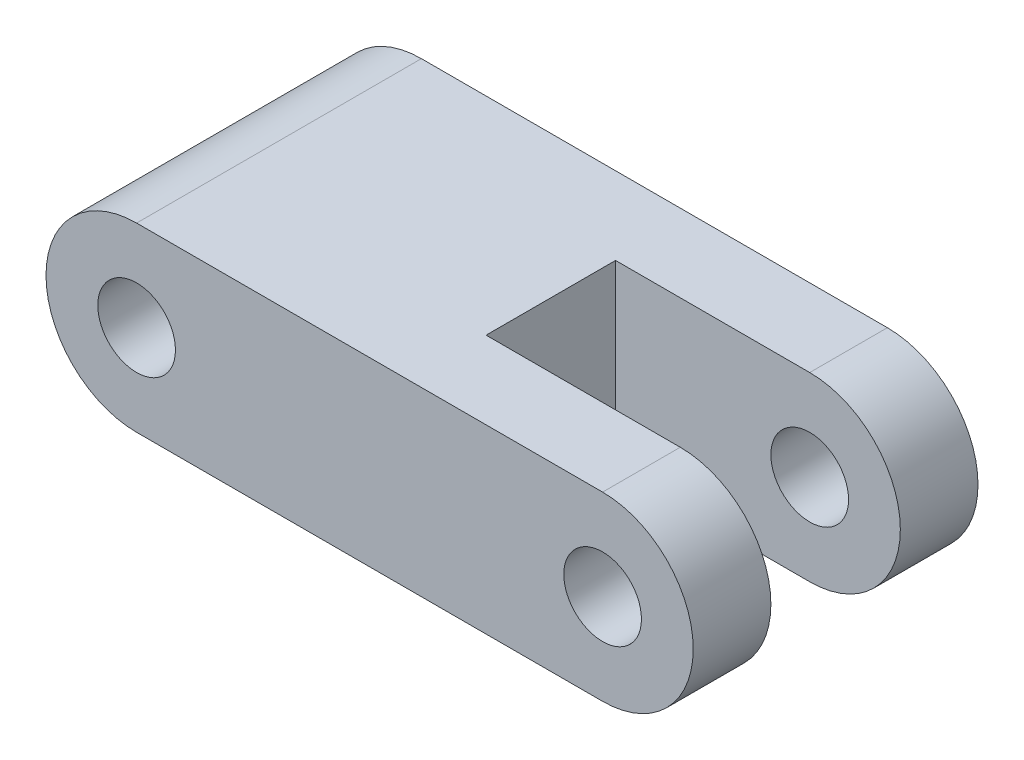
from build123d import *

# Parameters (mm, degrees)
BASE_DEPTH              = 11
PASSAGE_AXE_D           = 6
ESQUISSE4_W             = 22
ESQUISSE4_H             = 10
ENL_V_MAT_EXTRU_1_DEPTH = 47.540305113


with BuildPart() as part:
    # Esquisse1 → BASE (new, symmetric)
    with BuildSketch(Plane.XY):
        with BuildLine():
            Line((0, 7), (36, 7))
            ThreePointArc((36, 7), (43, 0), (36, -7))
            Line((36, -7), (0, -7))
            ThreePointArc((0, -7), (-7, 0), (0, 7))
        make_face()
    extrude(amount=BASE_DEPTH, both=True)

    # PASSAGE AXE (through all)
    with Locations(Plane.XY.offset(11)):
        with Locations((36, 0), (0, 0)):
            Hole(PASSAGE_AXE_D / 2)

    # Esquisse4 → Enl_v. mat.-Extru.1 (cut, through all)
    with BuildSketch(Plane(origin=(0, 7, 0), x_dir=(-1, 0, 0), z_dir=(0, 1, 0))):
        with Locations((-32, 0)):
            Rectangle(ESQUISSE4_W, ESQUISSE4_H)
    extrude(amount=-ENL_V_MAT_EXTRU_1_DEPTH, mode=Mode.SUBTRACT)


solid = part.part
